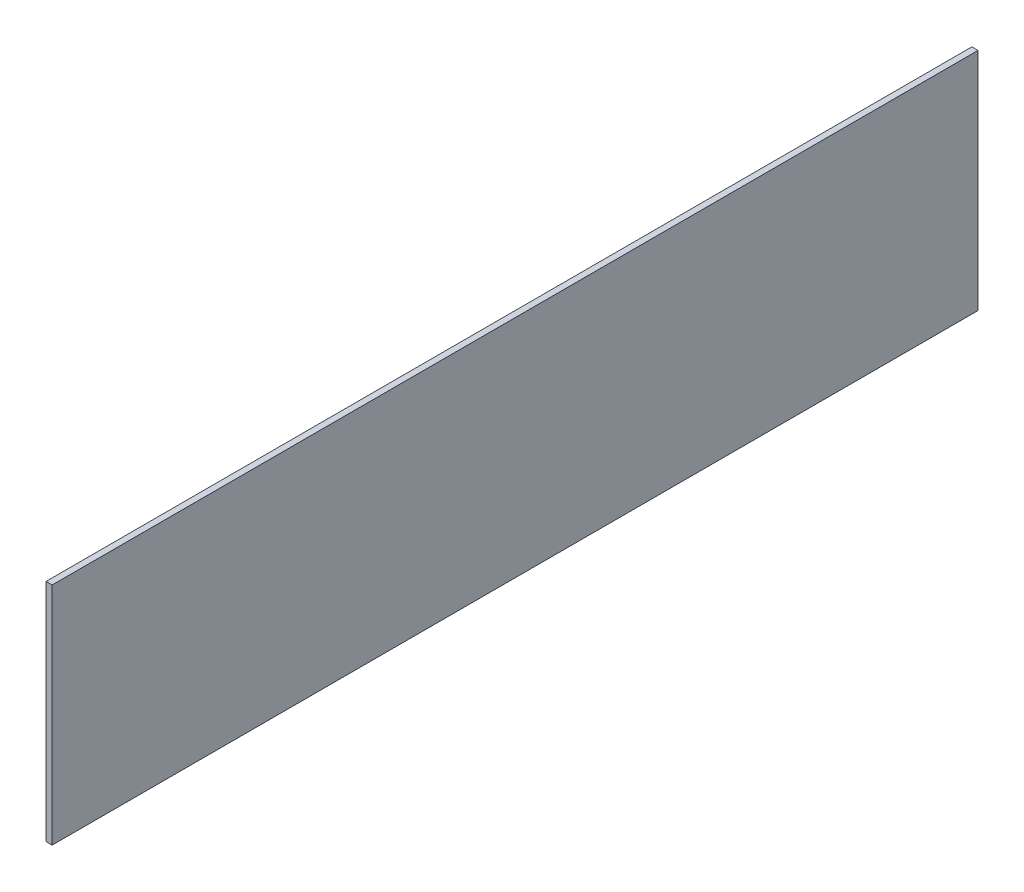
ISO-10303-21;
HEADER;
FILE_DESCRIPTION(('STEP AP214'),'2;1');
FILE_NAME('part.step','',(''),(''),'','','');
FILE_SCHEMA(('AUTOMOTIVE_DESIGN { 1 0 10303 214 1 1 1 1 }'));
ENDSEC;
DATA;
#1=APPLICATION_CONTEXT('core data for automotive mechanical design processes');
#2=APPLICATION_PROTOCOL_DEFINITION('international standard','automotive_design',2000,#1);
#3=PRODUCT_CONTEXT('',#1,'mechanical');
#4=PRODUCT('Part','Part','',(#3));
#5=PRODUCT_RELATED_PRODUCT_CATEGORY('part','',(#4));
#6=PRODUCT_DEFINITION_FORMATION('','',#4);
#7=PRODUCT_DEFINITION_CONTEXT('part definition',#1,'design');
#8=PRODUCT_DEFINITION('design','',#6,#7);
#9=PRODUCT_DEFINITION_SHAPE('','',#8);
#10=(LENGTH_UNIT() NAMED_UNIT(*) SI_UNIT(.MILLI.,.METRE.));
#11=(NAMED_UNIT(*) PLANE_ANGLE_UNIT() SI_UNIT($,.RADIAN.));
#12=(NAMED_UNIT(*) SI_UNIT($,.STERADIAN.) SOLID_ANGLE_UNIT());
#13=UNCERTAINTY_MEASURE_WITH_UNIT(LENGTH_MEASURE(1.E-05),#10,'distance_accuracy_value','');
#14=(GEOMETRIC_REPRESENTATION_CONTEXT(3) GLOBAL_UNCERTAINTY_ASSIGNED_CONTEXT((#13)) GLOBAL_UNIT_ASSIGNED_CONTEXT((#10,
#11,#12)) REPRESENTATION_CONTEXT('',''));
#15=CARTESIAN_POINT('',(0.,0.,0.));
#16=DIRECTION('',(0.,0.,1.));
#17=DIRECTION('',(1.,0.,0.));
#18=AXIS2_PLACEMENT_3D('',#15,#16,#17);
#19=CARTESIAN_POINT('',(3.,0.,0.));
#20=DIRECTION('',(0.,0.,-1.));
#21=DIRECTION('',(-1.,0.,0.));
#22=AXIS2_PLACEMENT_3D('',#19,#20,#21);
#23=PLANE('',#22);
#24=DIRECTION('',(0.,-1.,0.));
#25=VECTOR('',#24,1.);
#26=CARTESIAN_POINT('',(0.,0.,0.));
#27=LINE('',#26,#25);
#28=CARTESIAN_POINT('',(0.,110.,0.));
#29=VERTEX_POINT('',#28);
#30=CARTESIAN_POINT('',(0.,0.,0.));
#31=VERTEX_POINT('',#30);
#32=EDGE_CURVE('E113',#29,#31,#27,.T.);
#33=ORIENTED_EDGE('',*,*,#32,.T.);
#34=DIRECTION('',(-1.,0.,0.));
#35=VECTOR('',#34,1.);
#36=CARTESIAN_POINT('',(3.,0.,0.));
#37=LINE('',#36,#35);
#38=CARTESIAN_POINT('',(3.,0.,0.));
#39=VERTEX_POINT('',#38);
#40=EDGE_CURVE('E11',#39,#31,#37,.T.);
#41=ORIENTED_EDGE('',*,*,#40,.F.);
#42=DIRECTION('',(0.,-1.,0.));
#43=VECTOR('',#42,1.);
#44=CARTESIAN_POINT('',(3.,0.,0.));
#45=LINE('',#44,#43);
#46=CARTESIAN_POINT('',(3.,110.,0.));
#47=VERTEX_POINT('',#46);
#48=EDGE_CURVE('E97',#47,#39,#45,.T.);
#49=ORIENTED_EDGE('',*,*,#48,.F.);
#50=DIRECTION('',(-1.,0.,0.));
#51=VECTOR('',#50,1.);
#52=CARTESIAN_POINT('',(3.,110.,0.));
#53=LINE('',#52,#51);
#54=EDGE_CURVE('E109',#47,#29,#53,.T.);
#55=ORIENTED_EDGE('',*,*,#54,.T.);
#56=EDGE_LOOP('',(#33,#41,#49,#55));
#57=FACE_BOUND('',#56,.T.);
#58=ADVANCED_FACE('F45',(#57),#23,.F.);
#59=CARTESIAN_POINT('',(3.,0.,0.));
#60=DIRECTION('',(0.,1.,0.));
#61=DIRECTION('',(0.,0.,1.));
#62=AXIS2_PLACEMENT_3D('',#59,#60,#61);
#63=PLANE('',#62);
#64=DIRECTION('',(0.,0.,-1.));
#65=VECTOR('',#64,1.);
#66=CARTESIAN_POINT('',(0.,0.,0.));
#67=LINE('',#66,#65);
#68=CARTESIAN_POINT('',(0.,0.,-452.));
#69=VERTEX_POINT('',#68);
#70=EDGE_CURVE('E102',#31,#69,#67,.T.);
#71=ORIENTED_EDGE('',*,*,#70,.T.);
#72=DIRECTION('',(-1.,0.,0.));
#73=VECTOR('',#72,1.);
#74=CARTESIAN_POINT('',(3.,0.,-452.));
#75=LINE('',#74,#73);
#76=CARTESIAN_POINT('',(3.,0.,-452.));
#77=VERTEX_POINT('',#76);
#78=EDGE_CURVE('E54',#77,#69,#75,.T.);
#79=ORIENTED_EDGE('',*,*,#78,.F.);
#80=DIRECTION('',(0.,0.,-1.));
#81=VECTOR('',#80,1.);
#82=CARTESIAN_POINT('',(3.,0.,0.));
#83=LINE('',#82,#81);
#84=EDGE_CURVE('E92',#39,#77,#83,.T.);
#85=ORIENTED_EDGE('',*,*,#84,.F.);
#86=ORIENTED_EDGE('',*,*,#40,.T.);
#87=EDGE_LOOP('',(#71,#79,#85,#86));
#88=FACE_BOUND('',#87,.T.);
#89=ADVANCED_FACE('F101',(#88),#63,.F.);
#90=CARTESIAN_POINT('',(3.,0.,-452.));
#91=DIRECTION('',(0.,0.,1.));
#92=DIRECTION('',(1.,0.,0.));
#93=AXIS2_PLACEMENT_3D('',#90,#91,#92);
#94=PLANE('',#93);
#95=DIRECTION('',(0.,1.,0.));
#96=VECTOR('',#95,1.);
#97=CARTESIAN_POINT('',(0.,0.,-452.));
#98=LINE('',#97,#96);
#99=CARTESIAN_POINT('',(0.,110.,-452.));
#100=VERTEX_POINT('',#99);
#101=EDGE_CURVE('E79',#69,#100,#98,.T.);
#102=ORIENTED_EDGE('',*,*,#101,.T.);
#103=DIRECTION('',(-1.,0.,0.));
#104=VECTOR('',#103,1.);
#105=CARTESIAN_POINT('',(3.,110.,-452.));
#106=LINE('',#105,#104);
#107=CARTESIAN_POINT('',(3.,110.,-452.));
#108=VERTEX_POINT('',#107);
#109=EDGE_CURVE('E104',#108,#100,#106,.T.);
#110=ORIENTED_EDGE('',*,*,#109,.F.);
#111=DIRECTION('',(0.,1.,0.));
#112=VECTOR('',#111,1.);
#113=CARTESIAN_POINT('',(3.,0.,-452.));
#114=LINE('',#113,#112);
#115=EDGE_CURVE('E95',#77,#108,#114,.T.);
#116=ORIENTED_EDGE('',*,*,#115,.F.);
#117=ORIENTED_EDGE('',*,*,#78,.T.);
#118=EDGE_LOOP('',(#102,#110,#116,#117));
#119=FACE_BOUND('',#118,.T.);
#120=ADVANCED_FACE('F105',(#119),#94,.F.);
#121=CARTESIAN_POINT('',(3.,110.,0.));
#122=DIRECTION('',(0.,-1.,0.));
#123=DIRECTION('',(0.,0.,-1.));
#124=AXIS2_PLACEMENT_3D('',#121,#122,#123);
#125=PLANE('',#124);
#126=DIRECTION('',(0.,0.,1.));
#127=VECTOR('',#126,1.);
#128=CARTESIAN_POINT('',(0.,110.,0.));
#129=LINE('',#128,#127);
#130=EDGE_CURVE('E85',#100,#29,#129,.T.);
#131=ORIENTED_EDGE('',*,*,#130,.T.);
#132=ORIENTED_EDGE('',*,*,#54,.F.);
#133=DIRECTION('',(0.,0.,1.));
#134=VECTOR('',#133,1.);
#135=CARTESIAN_POINT('',(3.,110.,0.));
#136=LINE('',#135,#134);
#137=EDGE_CURVE('E62',#108,#47,#136,.T.);
#138=ORIENTED_EDGE('',*,*,#137,.F.);
#139=ORIENTED_EDGE('',*,*,#109,.T.);
#140=EDGE_LOOP('',(#131,#132,#138,#139));
#141=FACE_BOUND('',#140,.T.);
#142=ADVANCED_FACE('F126',(#141),#125,.F.);
#143=CARTESIAN_POINT('',(3.,0.,0.));
#144=DIRECTION('',(-1.,0.,0.));
#145=DIRECTION('',(0.,0.,1.));
#146=AXIS2_PLACEMENT_3D('',#143,#144,#145);
#147=PLANE('',#146);
#148=ORIENTED_EDGE('',*,*,#48,.T.);
#149=ORIENTED_EDGE('',*,*,#84,.T.);
#150=ORIENTED_EDGE('',*,*,#115,.T.);
#151=ORIENTED_EDGE('',*,*,#137,.T.);
#152=EDGE_LOOP('',(#148,#149,#150,#151));
#153=FACE_BOUND('',#152,.T.);
#154=ADVANCED_FACE('F93',(#153),#147,.F.);
#155=CARTESIAN_POINT('',(0.,0.,0.));
#156=DIRECTION('',(-1.,0.,0.));
#157=DIRECTION('',(0.,0.,1.));
#158=AXIS2_PLACEMENT_3D('',#155,#156,#157);
#159=PLANE('',#158);
#160=ORIENTED_EDGE('',*,*,#32,.F.);
#161=ORIENTED_EDGE('',*,*,#130,.F.);
#162=ORIENTED_EDGE('',*,*,#101,.F.);
#163=ORIENTED_EDGE('',*,*,#70,.F.);
#164=EDGE_LOOP('',(#160,#161,#162,#163));
#165=FACE_BOUND('',#164,.T.);
#166=ADVANCED_FACE('F129',(#165),#159,.T.);
#167=CLOSED_SHELL('',(#58,#89,#120,#142,#154,#166));
#168=MANIFOLD_SOLID_BREP('B2',#167);
#169=ADVANCED_BREP_SHAPE_REPRESENTATION('',(#18,#168),#14);
#170=SHAPE_DEFINITION_REPRESENTATION(#9,#169);
ENDSEC;
END-ISO-10303-21;
